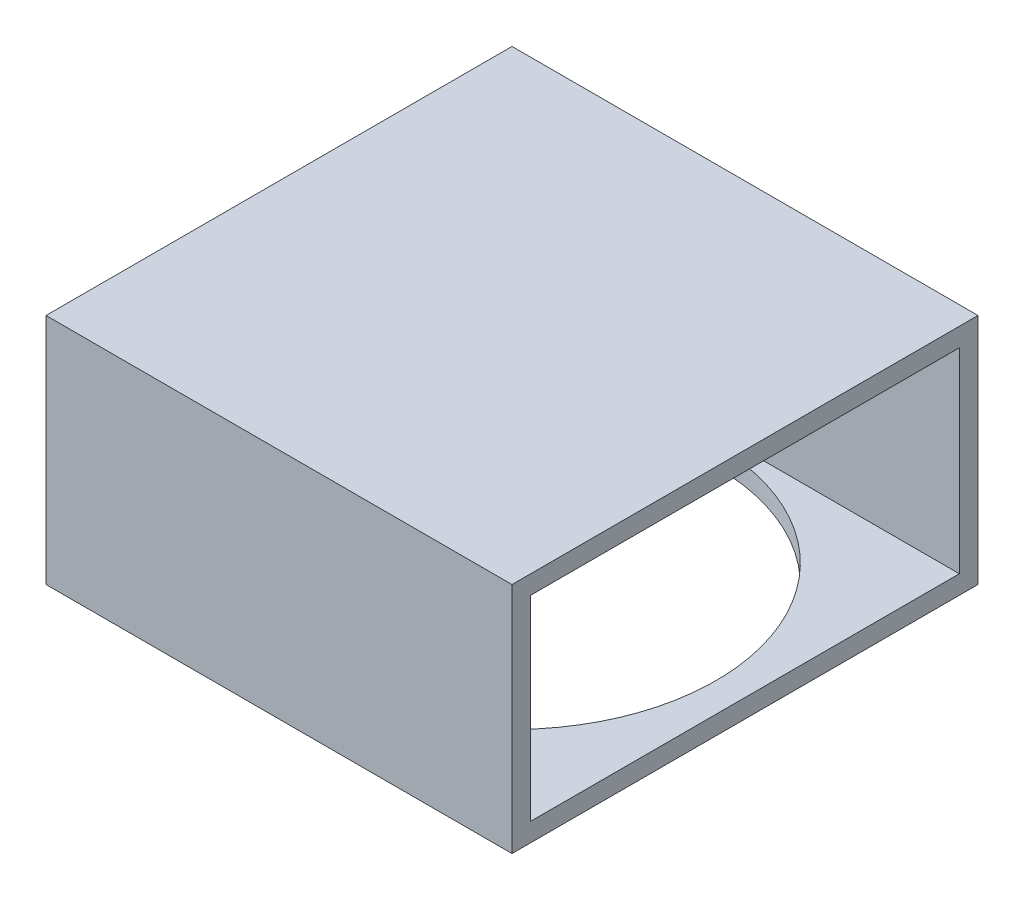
ISO-10303-21;
HEADER;
FILE_DESCRIPTION(('STEP AP214'),'2;1');
FILE_NAME('part.step','',(''),(''),'','','');
FILE_SCHEMA(('AUTOMOTIVE_DESIGN { 1 0 10303 214 1 1 1 1 }'));
ENDSEC;
DATA;
#1=APPLICATION_CONTEXT('core data for automotive mechanical design processes');
#2=APPLICATION_PROTOCOL_DEFINITION('international standard','automotive_design',2000,#1);
#3=PRODUCT_CONTEXT('',#1,'mechanical');
#4=PRODUCT('Part','Part','',(#3));
#5=PRODUCT_RELATED_PRODUCT_CATEGORY('part','',(#4));
#6=PRODUCT_DEFINITION_FORMATION('','',#4);
#7=PRODUCT_DEFINITION_CONTEXT('part definition',#1,'design');
#8=PRODUCT_DEFINITION('design','',#6,#7);
#9=PRODUCT_DEFINITION_SHAPE('','',#8);
#10=(LENGTH_UNIT() NAMED_UNIT(*) SI_UNIT(.MILLI.,.METRE.));
#11=(NAMED_UNIT(*) PLANE_ANGLE_UNIT() SI_UNIT($,.RADIAN.));
#12=(NAMED_UNIT(*) SI_UNIT($,.STERADIAN.) SOLID_ANGLE_UNIT());
#13=UNCERTAINTY_MEASURE_WITH_UNIT(LENGTH_MEASURE(1.E-05),#10,'distance_accuracy_value','');
#14=(GEOMETRIC_REPRESENTATION_CONTEXT(3) GLOBAL_UNCERTAINTY_ASSIGNED_CONTEXT((#13)) GLOBAL_UNIT_ASSIGNED_CONTEXT((#10,
#11,#12)) REPRESENTATION_CONTEXT('',''));
#15=CARTESIAN_POINT('',(0.,0.,0.));
#16=DIRECTION('',(0.,0.,1.));
#17=DIRECTION('',(1.,0.,0.));
#18=AXIS2_PLACEMENT_3D('',#15,#16,#17);
#19=CARTESIAN_POINT('',(100.,0.,0.));
#20=DIRECTION('',(-1.,0.,0.));
#21=DIRECTION('',(0.,0.,1.));
#22=AXIS2_PLACEMENT_3D('',#19,#20,#21);
#23=PLANE('',#22);
#24=DIRECTION('',(0.,1.,0.));
#25=VECTOR('',#24,1.);
#26=CARTESIAN_POINT('',(100.,0.,0.));
#27=LINE('',#26,#25);
#28=CARTESIAN_POINT('',(100.,-50.,0.));
#29=VERTEX_POINT('',#28);
#30=CARTESIAN_POINT('',(100.,0.,0.));
#31=VERTEX_POINT('',#30);
#32=EDGE_CURVE('E136',#29,#31,#27,.T.);
#33=ORIENTED_EDGE('',*,*,#32,.T.);
#34=DIRECTION('',(0.,0.,1.));
#35=VECTOR('',#34,1.);
#36=CARTESIAN_POINT('',(100.,0.,0.));
#37=LINE('',#36,#35);
#38=CARTESIAN_POINT('',(100.,0.,100.));
#39=VERTEX_POINT('',#38);
#40=EDGE_CURVE('E139',#31,#39,#37,.T.);
#41=ORIENTED_EDGE('',*,*,#40,.T.);
#42=DIRECTION('',(0.,-1.,0.));
#43=VECTOR('',#42,1.);
#44=CARTESIAN_POINT('',(100.,0.,100.));
#45=LINE('',#44,#43);
#46=CARTESIAN_POINT('',(100.,-50.,100.));
#47=VERTEX_POINT('',#46);
#48=EDGE_CURVE('E142',#39,#47,#45,.T.);
#49=ORIENTED_EDGE('',*,*,#48,.T.);
#50=DIRECTION('',(0.,0.,-1.));
#51=VECTOR('',#50,1.);
#52=CARTESIAN_POINT('',(100.,-50.,0.));
#53=LINE('',#52,#51);
#54=EDGE_CURVE('E144',#47,#29,#53,.T.);
#55=ORIENTED_EDGE('',*,*,#54,.T.);
#56=EDGE_LOOP('',(#33,#41,#49,#55));
#57=FACE_BOUND('',#56,.T.);
#58=DIRECTION('',(0.,-1.,0.));
#59=VECTOR('',#58,1.);
#60=CARTESIAN_POINT('',(100.,-4.00000000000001,96.));
#61=LINE('',#60,#59);
#62=CARTESIAN_POINT('',(100.,-4.00000000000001,96.));
#63=VERTEX_POINT('',#62);
#64=CARTESIAN_POINT('',(100.,-46.,96.));
#65=VERTEX_POINT('',#64);
#66=EDGE_CURVE('E98',#63,#65,#61,.T.);
#67=ORIENTED_EDGE('',*,*,#66,.F.);
#68=DIRECTION('',(0.,0.,1.));
#69=VECTOR('',#68,1.);
#70=CARTESIAN_POINT('',(100.,-4.00000000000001,96.));
#71=LINE('',#70,#69);
#72=CARTESIAN_POINT('',(100.,-4.00000000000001,4.));
#73=VERTEX_POINT('',#72);
#74=EDGE_CURVE('E120',#73,#63,#71,.T.);
#75=ORIENTED_EDGE('',*,*,#74,.F.);
#76=DIRECTION('',(0.,1.,0.));
#77=VECTOR('',#76,1.);
#78=CARTESIAN_POINT('',(100.,-4.00000000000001,4.));
#79=LINE('',#78,#77);
#80=CARTESIAN_POINT('',(100.,-46.,4.));
#81=VERTEX_POINT('',#80);
#82=EDGE_CURVE('E118',#81,#73,#79,.T.);
#83=ORIENTED_EDGE('',*,*,#82,.F.);
#84=DIRECTION('',(0.,0.,-1.));
#85=VECTOR('',#84,1.);
#86=CARTESIAN_POINT('',(100.,-46.,96.));
#87=LINE('',#86,#85);
#88=EDGE_CURVE('E106',#65,#81,#87,.T.);
#89=ORIENTED_EDGE('',*,*,#88,.F.);
#90=EDGE_LOOP('',(#67,#75,#83,#89));
#91=FACE_BOUND('',#90,.T.);
#92=ADVANCED_FACE('F33',(#57,#91),#23,.F.);
#93=CARTESIAN_POINT('',(0.,0.,0.));
#94=DIRECTION('',(-1.,0.,0.));
#95=DIRECTION('',(0.,0.,1.));
#96=AXIS2_PLACEMENT_3D('',#93,#94,#95);
#97=PLANE('',#96);
#98=DIRECTION('',(0.,1.,0.));
#99=VECTOR('',#98,1.);
#100=CARTESIAN_POINT('',(0.,0.,0.));
#101=LINE('',#100,#99);
#102=CARTESIAN_POINT('',(0.,-50.,0.));
#103=VERTEX_POINT('',#102);
#104=CARTESIAN_POINT('',(0.,0.,0.));
#105=VERTEX_POINT('',#104);
#106=EDGE_CURVE('E114',#103,#105,#101,.T.);
#107=ORIENTED_EDGE('',*,*,#106,.F.);
#108=DIRECTION('',(0.,0.,-1.));
#109=VECTOR('',#108,1.);
#110=CARTESIAN_POINT('',(0.,-50.,0.));
#111=LINE('',#110,#109);
#112=CARTESIAN_POINT('',(0.,-50.,100.));
#113=VERTEX_POINT('',#112);
#114=EDGE_CURVE('E140',#113,#103,#111,.T.);
#115=ORIENTED_EDGE('',*,*,#114,.F.);
#116=DIRECTION('',(0.,-1.,0.));
#117=VECTOR('',#116,1.);
#118=CARTESIAN_POINT('',(0.,0.,100.));
#119=LINE('',#118,#117);
#120=CARTESIAN_POINT('',(0.,0.,100.));
#121=VERTEX_POINT('',#120);
#122=EDGE_CURVE('E151',#121,#113,#119,.T.);
#123=ORIENTED_EDGE('',*,*,#122,.F.);
#124=DIRECTION('',(0.,0.,1.));
#125=VECTOR('',#124,1.);
#126=CARTESIAN_POINT('',(0.,0.,0.));
#127=LINE('',#126,#125);
#128=EDGE_CURVE('E149',#105,#121,#127,.T.);
#129=ORIENTED_EDGE('',*,*,#128,.F.);
#130=EDGE_LOOP('',(#107,#115,#123,#129));
#131=FACE_BOUND('',#130,.T.);
#132=DIRECTION('',(0.,0.,1.));
#133=VECTOR('',#132,1.);
#134=CARTESIAN_POINT('',(0.,-4.00000000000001,96.));
#135=LINE('',#134,#133);
#136=CARTESIAN_POINT('',(0.,-4.00000000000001,4.));
#137=VERTEX_POINT('',#136);
#138=CARTESIAN_POINT('',(0.,-4.00000000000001,96.));
#139=VERTEX_POINT('',#138);
#140=EDGE_CURVE('E107',#137,#139,#135,.T.);
#141=ORIENTED_EDGE('',*,*,#140,.T.);
#142=DIRECTION('',(0.,-1.,0.));
#143=VECTOR('',#142,1.);
#144=CARTESIAN_POINT('',(0.,-4.00000000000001,96.));
#145=LINE('',#144,#143);
#146=CARTESIAN_POINT('',(0.,-46.,96.));
#147=VERTEX_POINT('',#146);
#148=EDGE_CURVE('E56',#139,#147,#145,.T.);
#149=ORIENTED_EDGE('',*,*,#148,.T.);
#150=DIRECTION('',(0.,0.,-1.));
#151=VECTOR('',#150,1.);
#152=CARTESIAN_POINT('',(0.,-46.,96.));
#153=LINE('',#152,#151);
#154=CARTESIAN_POINT('',(0.,-46.,4.));
#155=VERTEX_POINT('',#154);
#156=EDGE_CURVE('E113',#147,#155,#153,.T.);
#157=ORIENTED_EDGE('',*,*,#156,.T.);
#158=DIRECTION('',(0.,1.,0.));
#159=VECTOR('',#158,1.);
#160=CARTESIAN_POINT('',(0.,-4.00000000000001,4.));
#161=LINE('',#160,#159);
#162=EDGE_CURVE('E128',#155,#137,#161,.T.);
#163=ORIENTED_EDGE('',*,*,#162,.T.);
#164=EDGE_LOOP('',(#141,#149,#157,#163));
#165=FACE_BOUND('',#164,.T.);
#166=ADVANCED_FACE('F169',(#131,#165),#97,.T.);
#167=CARTESIAN_POINT('',(100.,0.,0.));
#168=DIRECTION('',(0.,0.,1.));
#169=DIRECTION('',(0.,-1.,0.));
#170=AXIS2_PLACEMENT_3D('',#167,#168,#169);
#171=PLANE('',#170);
#172=ORIENTED_EDGE('',*,*,#106,.T.);
#173=DIRECTION('',(-1.,0.,0.));
#174=VECTOR('',#173,1.);
#175=CARTESIAN_POINT('',(100.,0.,0.));
#176=LINE('',#175,#174);
#177=EDGE_CURVE('E11',#31,#105,#176,.T.);
#178=ORIENTED_EDGE('',*,*,#177,.F.);
#179=ORIENTED_EDGE('',*,*,#32,.F.);
#180=DIRECTION('',(-1.,0.,0.));
#181=VECTOR('',#180,1.);
#182=CARTESIAN_POINT('',(100.,-50.,0.));
#183=LINE('',#182,#181);
#184=EDGE_CURVE('E146',#29,#103,#183,.T.);
#185=ORIENTED_EDGE('',*,*,#184,.T.);
#186=EDGE_LOOP('',(#172,#178,#179,#185));
#187=FACE_BOUND('',#186,.T.);
#188=ADVANCED_FACE('F35',(#187),#171,.F.);
#189=CARTESIAN_POINT('',(100.,0.,0.));
#190=DIRECTION('',(0.,-1.,0.));
#191=DIRECTION('',(0.,0.,-1.));
#192=AXIS2_PLACEMENT_3D('',#189,#190,#191);
#193=PLANE('',#192);
#194=ORIENTED_EDGE('',*,*,#128,.T.);
#195=DIRECTION('',(-1.,0.,0.));
#196=VECTOR('',#195,1.);
#197=CARTESIAN_POINT('',(100.,0.,100.));
#198=LINE('',#197,#196);
#199=EDGE_CURVE('E41',#39,#121,#198,.T.);
#200=ORIENTED_EDGE('',*,*,#199,.F.);
#201=ORIENTED_EDGE('',*,*,#40,.F.);
#202=ORIENTED_EDGE('',*,*,#177,.T.);
#203=EDGE_LOOP('',(#194,#200,#201,#202));
#204=FACE_BOUND('',#203,.T.);
#205=ADVANCED_FACE('F179',(#204),#193,.F.);
#206=CARTESIAN_POINT('',(100.,0.,100.));
#207=DIRECTION('',(0.,0.,-1.));
#208=DIRECTION('',(-1.,0.,0.));
#209=AXIS2_PLACEMENT_3D('',#206,#207,#208);
#210=PLANE('',#209);
#211=ORIENTED_EDGE('',*,*,#122,.T.);
#212=DIRECTION('',(-1.,0.,0.));
#213=VECTOR('',#212,1.);
#214=CARTESIAN_POINT('',(100.,-50.,100.));
#215=LINE('',#214,#213);
#216=EDGE_CURVE('E156',#47,#113,#215,.T.);
#217=ORIENTED_EDGE('',*,*,#216,.F.);
#218=ORIENTED_EDGE('',*,*,#48,.F.);
#219=ORIENTED_EDGE('',*,*,#199,.T.);
#220=EDGE_LOOP('',(#211,#217,#218,#219));
#221=FACE_BOUND('',#220,.T.);
#222=ADVANCED_FACE('F163',(#221),#210,.F.);
#223=CARTESIAN_POINT('',(100.,-50.,0.));
#224=DIRECTION('',(0.,1.,0.));
#225=DIRECTION('',(0.,0.,1.));
#226=AXIS2_PLACEMENT_3D('',#223,#224,#225);
#227=PLANE('',#226);
#228=CARTESIAN_POINT('',(50.,-50.,50.));
#229=DIRECTION('',(0.,-1.,0.));
#230=DIRECTION('',(0.,0.,-1.));
#231=AXIS2_PLACEMENT_3D('',#228,#229,#230);
#232=CIRCLE('',#231,43.75);
#233=CARTESIAN_POINT('',(50.,-50.,6.25));
#234=VERTEX_POINT('',#233);
#235=EDGE_CURVE('E126',#234,#234,#232,.T.);
#236=ORIENTED_EDGE('',*,*,#235,.F.);
#237=EDGE_LOOP('',(#236));
#238=FACE_BOUND('',#237,.T.);
#239=ORIENTED_EDGE('',*,*,#114,.T.);
#240=ORIENTED_EDGE('',*,*,#184,.F.);
#241=ORIENTED_EDGE('',*,*,#54,.F.);
#242=ORIENTED_EDGE('',*,*,#216,.T.);
#243=EDGE_LOOP('',(#239,#240,#241,#242));
#244=FACE_BOUND('',#243,.T.);
#245=ADVANCED_FACE('F173',(#238,#244),#227,.F.);
#246=CARTESIAN_POINT('',(100.,-4.00000000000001,96.));
#247=DIRECTION('',(0.,0.,-1.));
#248=DIRECTION('',(-1.,0.,0.));
#249=AXIS2_PLACEMENT_3D('',#246,#247,#248);
#250=PLANE('',#249);
#251=ORIENTED_EDGE('',*,*,#148,.F.);
#252=DIRECTION('',(-1.,0.,0.));
#253=VECTOR('',#252,1.);
#254=CARTESIAN_POINT('',(100.,-4.00000000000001,96.));
#255=LINE('',#254,#253);
#256=EDGE_CURVE('E102',#63,#139,#255,.T.);
#257=ORIENTED_EDGE('',*,*,#256,.F.);
#258=ORIENTED_EDGE('',*,*,#66,.T.);
#259=DIRECTION('',(-1.,0.,0.));
#260=VECTOR('',#259,1.);
#261=CARTESIAN_POINT('',(100.,-46.,96.));
#262=LINE('',#261,#260);
#263=EDGE_CURVE('E101',#65,#147,#262,.T.);
#264=ORIENTED_EDGE('',*,*,#263,.T.);
#265=EDGE_LOOP('',(#251,#257,#258,#264));
#266=FACE_BOUND('',#265,.T.);
#267=ADVANCED_FACE('F100',(#266),#250,.T.);
#268=CARTESIAN_POINT('',(100.,-46.,96.));
#269=DIRECTION('',(0.,1.,0.));
#270=DIRECTION('',(0.,0.,1.));
#271=AXIS2_PLACEMENT_3D('',#268,#269,#270);
#272=PLANE('',#271);
#273=CARTESIAN_POINT('',(50.,-46.,50.));
#274=DIRECTION('',(0.,1.,0.));
#275=DIRECTION('',(0.,0.,1.));
#276=AXIS2_PLACEMENT_3D('',#273,#274,#275);
#277=CIRCLE('',#276,43.75);
#278=CARTESIAN_POINT('',(50.,-46.,93.75));
#279=VERTEX_POINT('',#278);
#280=EDGE_CURVE('E203',#279,#279,#277,.F.);
#281=ORIENTED_EDGE('',*,*,#280,.T.);
#282=EDGE_LOOP('',(#281));
#283=FACE_BOUND('',#282,.T.);
#284=ORIENTED_EDGE('',*,*,#156,.F.);
#285=ORIENTED_EDGE('',*,*,#263,.F.);
#286=ORIENTED_EDGE('',*,*,#88,.T.);
#287=DIRECTION('',(-1.,0.,0.));
#288=VECTOR('',#287,1.);
#289=CARTESIAN_POINT('',(100.,-46.,4.));
#290=LINE('',#289,#288);
#291=EDGE_CURVE('E115',#81,#155,#290,.T.);
#292=ORIENTED_EDGE('',*,*,#291,.T.);
#293=EDGE_LOOP('',(#284,#285,#286,#292));
#294=FACE_BOUND('',#293,.T.);
#295=ADVANCED_FACE('F110',(#283,#294),#272,.T.);
#296=CARTESIAN_POINT('',(100.,-4.00000000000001,4.));
#297=DIRECTION('',(0.,0.,1.));
#298=DIRECTION('',(1.,0.,0.));
#299=AXIS2_PLACEMENT_3D('',#296,#297,#298);
#300=PLANE('',#299);
#301=ORIENTED_EDGE('',*,*,#162,.F.);
#302=ORIENTED_EDGE('',*,*,#291,.F.);
#303=ORIENTED_EDGE('',*,*,#82,.T.);
#304=DIRECTION('',(-1.,0.,0.));
#305=VECTOR('',#304,1.);
#306=CARTESIAN_POINT('',(100.,-4.00000000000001,4.));
#307=LINE('',#306,#305);
#308=EDGE_CURVE('E48',#73,#137,#307,.T.);
#309=ORIENTED_EDGE('',*,*,#308,.T.);
#310=EDGE_LOOP('',(#301,#302,#303,#309));
#311=FACE_BOUND('',#310,.T.);
#312=ADVANCED_FACE('F216',(#311),#300,.T.);
#313=CARTESIAN_POINT('',(100.,-4.00000000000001,96.));
#314=DIRECTION('',(0.,-1.,0.));
#315=DIRECTION('',(0.,0.,-1.));
#316=AXIS2_PLACEMENT_3D('',#313,#314,#315);
#317=PLANE('',#316);
#318=ORIENTED_EDGE('',*,*,#140,.F.);
#319=ORIENTED_EDGE('',*,*,#308,.F.);
#320=ORIENTED_EDGE('',*,*,#74,.T.);
#321=ORIENTED_EDGE('',*,*,#256,.T.);
#322=EDGE_LOOP('',(#318,#319,#320,#321));
#323=FACE_BOUND('',#322,.T.);
#324=ADVANCED_FACE('F211',(#323),#317,.T.);
#325=CARTESIAN_POINT('',(50.,0.00100000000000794,50.));
#326=DIRECTION('',(0.,-1.,0.));
#327=DIRECTION('',(0.,0.,-1.));
#328=AXIS2_PLACEMENT_3D('',#325,#326,#327);
#329=CYLINDRICAL_SURFACE('',#328,43.75);
#330=ORIENTED_EDGE('',*,*,#280,.F.);
#331=EDGE_LOOP('',(#330));
#332=FACE_BOUND('',#331,.T.);
#333=ORIENTED_EDGE('',*,*,#235,.T.);
#334=EDGE_LOOP('',(#333));
#335=FACE_BOUND('',#334,.T.);
#336=ADVANCED_FACE('F209',(#332,#335),#329,.F.);
#337=CLOSED_SHELL('',(#92,#166,#188,#205,#222,#245,#267,#295,#312,#324,#336));
#338=MANIFOLD_SOLID_BREP('B2',#337);
#339=ADVANCED_BREP_SHAPE_REPRESENTATION('',(#18,#338),#14);
#340=SHAPE_DEFINITION_REPRESENTATION(#9,#339);
ENDSEC;
END-ISO-10303-21;
